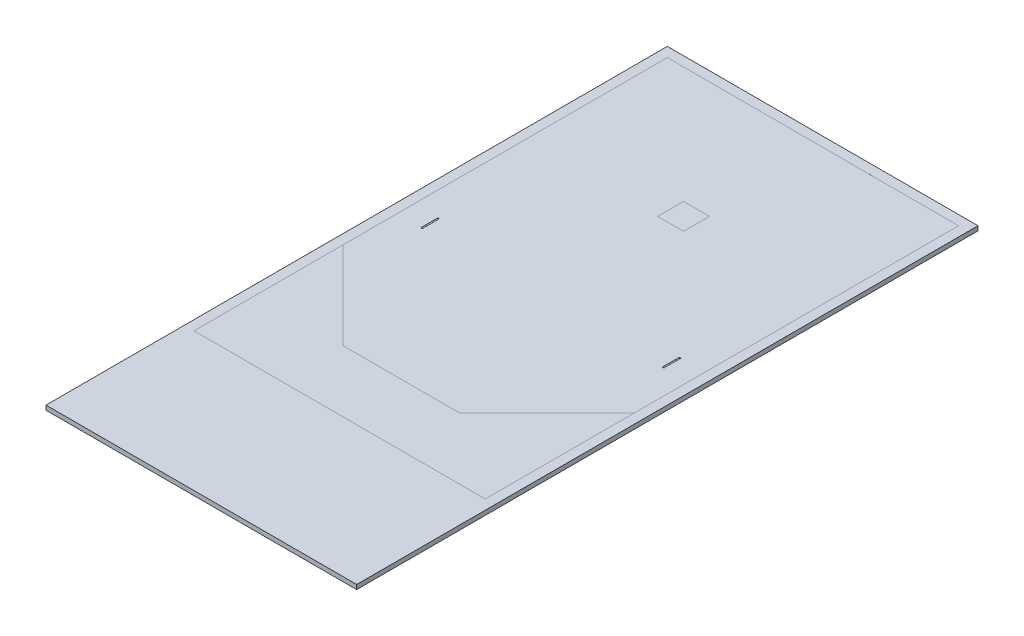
from build123d import *

# Parameters (mm, degrees)
SKETCH1_W           = 1219.2
SKETCH1_H           = 17.4625
BOSS_EXTRUDE1_DEPTH = 2438.4
CUT_EXTRUDE2_DEPTH  = 0.000254
CUT_EXTRUDE4_DEPTH  = 0.000508
SKETCH7_W           = 101.6
SKETCH7_H           = 101.6
BOSS_EXTRUDE2_DEPTH = 0.000508
CUT_EXTRUDE5_DEPTH  = 33.3375


with BuildPart() as part:
    # Sketch1 → Boss-Extrude1 (new body)
    with BuildSketch(Plane.XY):
        Rectangle(SKETCH1_W, SKETCH1_H)
    extrude(amount=-BOSS_EXTRUDE1_DEPTH)

    # Sketch5 → Cut-Extrude2 (cut)
    with BuildSketch(Plane(origin=(0, 8.73125, 0), x_dir=(1, 0, 0), z_dir=(0, 1, 0))):
        Polygon((-228.6, 784.8854), (-571.5, 1127.7854), (-571.5, 542.925), (571.5, 542.925), (571.5, 1127.7854), (228.6, 784.8854), align=None)
    extrude(amount=-CUT_EXTRUDE2_DEPTH, mode=Mode.SUBTRACT)

    # Sketch6 → Cut-Extrude4 (cut)
    with BuildSketch(Plane(origin=(0, 8.73125, 0), x_dir=(1, 0, 0), z_dir=(0, 1, 0))):
        Polygon((571.5, 2400.3), (571.5, 1127.7854), (228.6, 784.8854), (-228.6, 784.8854), (-571.5, 1127.7854), (-571.5, 2400.3), align=None)
    extrude(amount=-CUT_EXTRUDE4_DEPTH, mode=Mode.SUBTRACT)

    # Sketch7 → Boss-Extrude2 (add)
    with BuildSketch(Plane(origin=(0, 8.730742, 0), x_dir=(1, 0, 0), z_dir=(0, 1, 0))):
        with Locations((0, 1892.3)):
            Rectangle(SKETCH7_W, SKETCH7_H)
    extrude(amount=BOSS_EXTRUDE2_DEPTH)

    # Sketch8 → Cut-Extrude5 (cut, symmetric)
    with BuildSketch(Plane(origin=(0, 0, -1371.6), x_dir=(-1, 0, 0), z_dir=(0, 0, -1))):
        with BuildLine():
            ThreePointArc((-477.0374, 8.73125), (-473.8624, 5.55625), (-470.6874, 8.73125))
            Line((-470.6874, 8.73125), (-477.0374, 8.73125))
        make_face()
        with BuildLine():
            Line((-477.0374, 8.73125), (-470.6874, 8.73125))
            ThreePointArc((-470.6874, 8.73125), (-473.8624, 11.90625), (-477.0374, 8.73125))
        make_face()
    cut_extrude5 = extrude(amount=CUT_EXTRUDE5_DEPTH, both=True, mode=Mode.SUBTRACT)

    # Mirror1: Cut-Extrude5 across plane
    add(cut_extrude5.mirror(Plane(origin=(0, 0, 0), x_dir=(0, 0, 1), z_dir=(1, 0, 0))), mode=Mode.SUBTRACT)


solid = part.part
